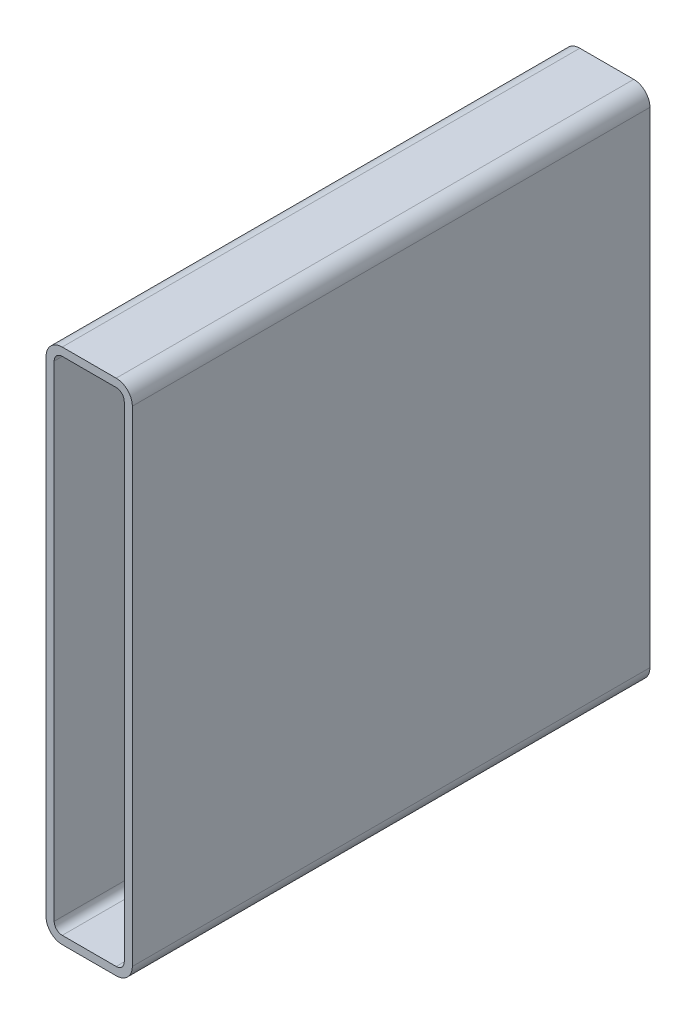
from build123d import *

# Parameters (mm, degrees)
BOSS_EXTRUDE1_DEPTH = 304.8


with BuildPart() as part:
    # Sketch1 → Boss-Extrude1 (new body)
    with BuildSketch(Plane.XY):
        with BuildLine():
            Line((9.525, 304.8), (41.275, 304.8))
            ThreePointArc((41.275, 304.8), (48.010192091, 302.010192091), (50.8, 295.275))
            Line((50.8, 295.275), (50.8, 9.525))
            ThreePointArc((50.8, 9.525), (48.010192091, 2.789807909), (41.275, 0))
            Line((41.275, 0), (9.525, 0))
            ThreePointArc((9.525, 0), (2.789807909, 2.789807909), (0, 9.525))
            Line((0, 9.525), (0, 295.275))
            ThreePointArc((0, 295.275), (2.789807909, 302.010192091), (9.525, 304.8))
        make_face()
        with BuildLine():
            Line((9.525, 300.0375), (41.275, 300.0375))
            ThreePointArc((41.275, 300.0375), (44.642596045, 298.642596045), (46.0375, 295.275))
            Line((46.0375, 295.275), (46.0375, 9.525))
            ThreePointArc((46.0375, 9.525), (44.642596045, 6.157403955), (41.275, 4.7625))
            Line((41.275, 4.7625), (9.525, 4.7625))
            ThreePointArc((9.525, 4.7625), (6.157403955, 6.157403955), (4.7625, 9.525))
            Line((4.7625, 9.525), (4.7625, 295.275))
            ThreePointArc((4.7625, 295.275), (6.157403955, 298.642596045), (9.525, 300.0375))
        make_face(mode=Mode.SUBTRACT)
    extrude(amount=BOSS_EXTRUDE1_DEPTH)


solid = part.part
